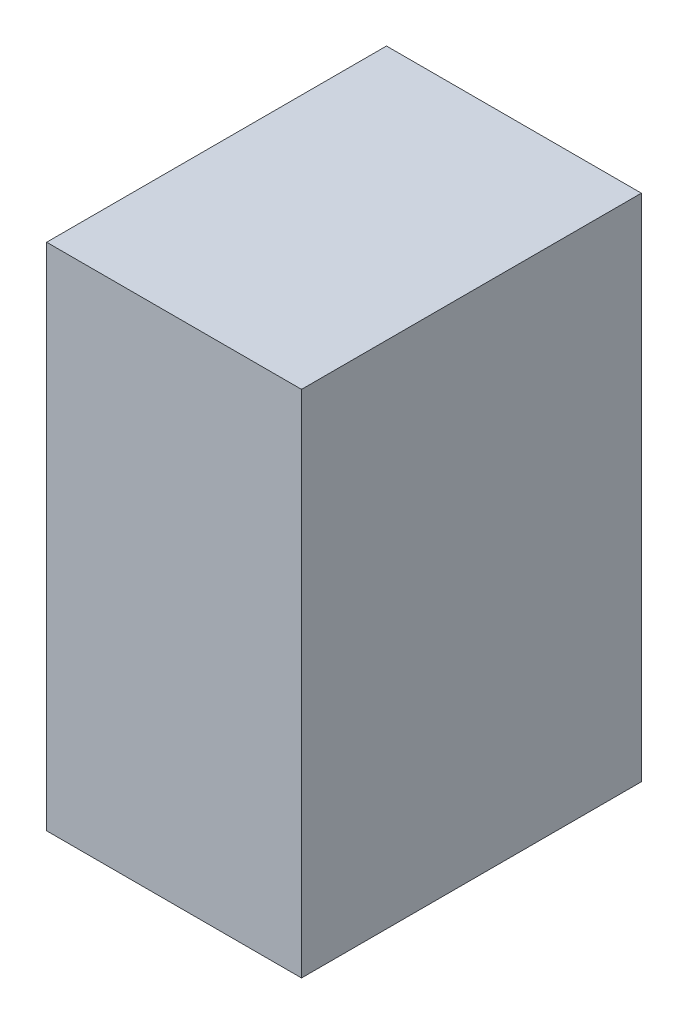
from build123d import *

# Parameters (mm, degrees)
SKETCH1_W      = 75
SKETCH1_H      = 100
EXTRUDE1_DEPTH = 150


with BuildPart() as part:
    # Sketch1 → Extrude1 (new body)
    with BuildSketch(Plane(origin=(0, 0, 0), x_dir=(1, 0, 0), z_dir=(0, 1, 0))):
        Rectangle(SKETCH1_W, SKETCH1_H)
    extrude(amount=EXTRUDE1_DEPTH)


solid = part.part
